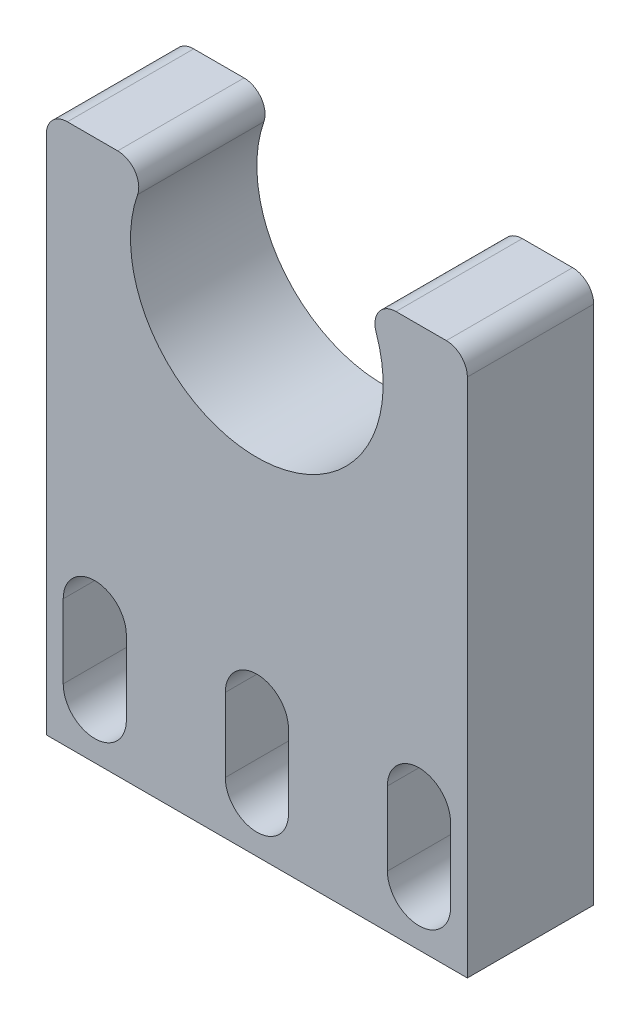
from build123d import *

# Parameters (mm, degrees)
BOSS_EXTRUDE2_DEPTH = 6


with BuildPart() as part:
    # Sketch1 → Boss-Extrude2 (new body)
    with BuildSketch(Plane.XY):
        with BuildLine():
            Line((-227.342156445, 12.698580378), (-217.342156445, 12.698580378))
            Line((-217.342156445, 12.698580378), (-217.342156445, 33.502473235))
            Line((-217.342156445, 33.502473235), (-217.342156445, 37.42062063))
            ThreePointArc((-217.342156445, 37.42062063), (-217.635049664, 38.127727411), (-218.342156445, 38.42062063))
            Line((-218.342156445, 38.42062063), (-220.733106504, 38.42062063))
            ThreePointArc((-220.733106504, 38.42062063), (-221.548433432, 37.999621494), (-221.677256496, 37.091104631))
            ThreePointArc((-221.677256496, 37.091104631), (-227.342156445, 29.11400864), (-233.007056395, 37.091104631))
            ThreePointArc((-233.007056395, 37.091104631), (-233.135879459, 37.999621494), (-233.951206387, 38.42062063))
            Line((-233.951206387, 38.42062063), (-236.342156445, 38.42062063))
            ThreePointArc((-236.342156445, 38.42062063), (-237.049263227, 38.127727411), (-237.342156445, 37.42062063))
            Line((-237.342156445, 37.42062063), (-237.342156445, 33.502473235))
            Line((-237.342156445, 33.502473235), (-237.342156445, 12.698580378))
            Line((-237.342156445, 12.698580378), (-227.342156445, 12.698580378))
        make_face()
        with BuildLine():
            Line((-233.540096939, 18.698580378), (-233.540096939, 15.198580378))
            ThreePointArc((-233.540096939, 15.198580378), (-235.040096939, 13.698580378), (-236.540096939, 15.198580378))
            Line((-236.540096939, 15.198580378), (-236.540096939, 18.698580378))
            ThreePointArc((-236.540096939, 18.698580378), (-235.040096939, 20.198580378), (-233.540096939, 18.698580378))
        make_face(mode=Mode.SUBTRACT)
        with BuildLine():
            Line((-225.840096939, 18.698580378), (-225.840096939, 15.198580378))
            ThreePointArc((-225.840096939, 15.198580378), (-227.340096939, 13.698580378), (-228.840096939, 15.198580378))
            Line((-228.840096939, 15.198580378), (-228.840096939, 18.698580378))
            ThreePointArc((-228.840096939, 18.698580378), (-227.340096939, 20.198580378), (-225.840096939, 18.698580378))
        make_face(mode=Mode.SUBTRACT)
        with BuildLine():
            Line((-218.140096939, 18.698580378), (-218.140096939, 15.198580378))
            ThreePointArc((-218.140096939, 15.198580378), (-219.640096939, 13.698580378), (-221.140096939, 15.198580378))
            Line((-221.140096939, 15.198580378), (-221.140096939, 18.698580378))
            ThreePointArc((-221.140096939, 18.698580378), (-219.640096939, 20.198580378), (-218.140096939, 18.698580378))
        make_face(mode=Mode.SUBTRACT)
    extrude(amount=BOSS_EXTRUDE2_DEPTH)


solid = part.part
